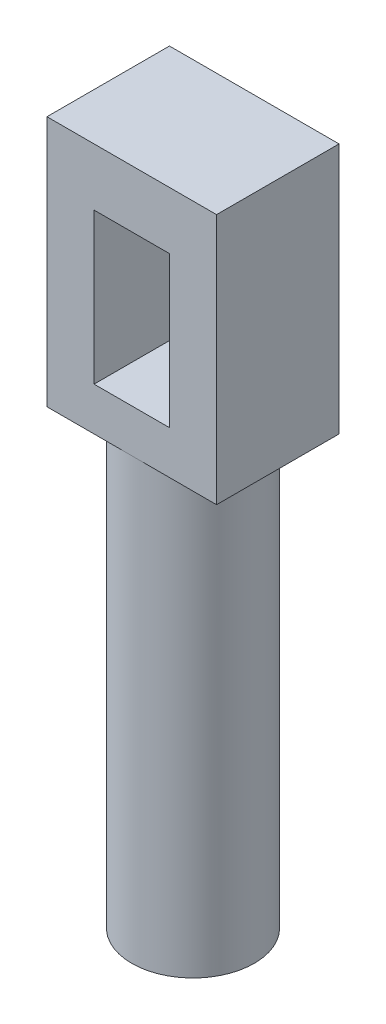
ISO-10303-21;
HEADER;
FILE_DESCRIPTION(('STEP AP214'),'2;1');
FILE_NAME('part.step','',(''),(''),'','','');
FILE_SCHEMA(('AUTOMOTIVE_DESIGN { 1 0 10303 214 1 1 1 1 }'));
ENDSEC;
DATA;
#1=APPLICATION_CONTEXT('core data for automotive mechanical design processes');
#2=APPLICATION_PROTOCOL_DEFINITION('international standard','automotive_design',2000,#1);
#3=PRODUCT_CONTEXT('',#1,'mechanical');
#4=PRODUCT('Part','Part','',(#3));
#5=PRODUCT_RELATED_PRODUCT_CATEGORY('part','',(#4));
#6=PRODUCT_DEFINITION_FORMATION('','',#4);
#7=PRODUCT_DEFINITION_CONTEXT('part definition',#1,'design');
#8=PRODUCT_DEFINITION('design','',#6,#7);
#9=PRODUCT_DEFINITION_SHAPE('','',#8);
#10=(LENGTH_UNIT() NAMED_UNIT(*) SI_UNIT(.MILLI.,.METRE.));
#11=(NAMED_UNIT(*) PLANE_ANGLE_UNIT() SI_UNIT($,.RADIAN.));
#12=(NAMED_UNIT(*) SI_UNIT($,.STERADIAN.) SOLID_ANGLE_UNIT());
#13=UNCERTAINTY_MEASURE_WITH_UNIT(LENGTH_MEASURE(1.E-05),#10,'distance_accuracy_value','');
#14=(GEOMETRIC_REPRESENTATION_CONTEXT(3) GLOBAL_UNCERTAINTY_ASSIGNED_CONTEXT((#13)) GLOBAL_UNIT_ASSIGNED_CONTEXT((#10,
#11,#12)) REPRESENTATION_CONTEXT('',''));
#15=CARTESIAN_POINT('',(0.,0.,0.));
#16=DIRECTION('',(0.,0.,1.));
#17=DIRECTION('',(1.,0.,0.));
#18=AXIS2_PLACEMENT_3D('',#15,#16,#17);
#19=CARTESIAN_POINT('',(0.,70.,0.));
#20=DIRECTION('',(0.,-1.,0.));
#21=DIRECTION('',(0.,0.,-1.));
#22=AXIS2_PLACEMENT_3D('',#19,#20,#21);
#23=CYLINDRICAL_SURFACE('',#22,9.75);
#24=CARTESIAN_POINT('',(0.,70.,0.));
#25=DIRECTION('',(0.,1.,0.));
#26=DIRECTION('',(0.,0.,1.));
#27=AXIS2_PLACEMENT_3D('',#24,#25,#26);
#28=CIRCLE('',#27,9.75);
#29=CARTESIAN_POINT('',(0.,70.,9.75));
#30=VERTEX_POINT('',#29);
#31=CARTESIAN_POINT('',(0.,70.,-9.75));
#32=VERTEX_POINT('',#31);
#33=EDGE_CURVE('E167',#30,#32,#28,.T.);
#34=ORIENTED_EDGE('',*,*,#33,.F.);
#35=EDGE_CURVE('E171',#32,#30,#28,.T.);
#36=ORIENTED_EDGE('',*,*,#35,.F.);
#37=EDGE_LOOP('',(#34,#36));
#38=FACE_BOUND('',#37,.T.);
#39=CARTESIAN_POINT('',(0.,0.,0.));
#40=DIRECTION('',(0.,1.,0.));
#41=DIRECTION('',(0.,0.,1.));
#42=AXIS2_PLACEMENT_3D('',#39,#40,#41);
#43=CIRCLE('',#42,9.75);
#44=CARTESIAN_POINT('',(0.,0.,9.75));
#45=VERTEX_POINT('',#44);
#46=EDGE_CURVE('E166',#45,#45,#43,.T.);
#47=ORIENTED_EDGE('',*,*,#46,.T.);
#48=EDGE_LOOP('',(#47));
#49=FACE_BOUND('',#48,.T.);
#50=ADVANCED_FACE('F34',(#38,#49),#23,.T.);
#51=CARTESIAN_POINT('',(0.,0.,0.));
#52=DIRECTION('',(0.,1.,0.));
#53=DIRECTION('',(0.,0.,1.));
#54=AXIS2_PLACEMENT_3D('',#51,#52,#53);
#55=PLANE('',#54);
#56=ORIENTED_EDGE('',*,*,#46,.F.);
#57=EDGE_LOOP('',(#56));
#58=FACE_BOUND('',#57,.T.);
#59=ADVANCED_FACE('F195',(#58),#55,.F.);
#60=CARTESIAN_POINT('',(0.,70.,0.));
#61=DIRECTION('',(0.,1.,0.));
#62=DIRECTION('',(0.,0.,1.));
#63=AXIS2_PLACEMENT_3D('',#60,#61,#62);
#64=PLANE('',#63);
#65=DIRECTION('',(1.,0.,0.));
#66=VECTOR('',#65,1.);
#67=CARTESIAN_POINT('',(-13.5,70.,9.75));
#68=LINE('',#67,#66);
#69=CARTESIAN_POINT('',(13.5,70.,9.75));
#70=VERTEX_POINT('',#69);
#71=EDGE_CURVE('E152',#30,#70,#68,.T.);
#72=ORIENTED_EDGE('',*,*,#71,.F.);
#73=ORIENTED_EDGE('',*,*,#33,.T.);
#74=DIRECTION('',(-1.,0.,0.));
#75=VECTOR('',#74,1.);
#76=CARTESIAN_POINT('',(-13.5,70.,-9.75));
#77=LINE('',#76,#75);
#78=CARTESIAN_POINT('',(13.5,70.,-9.75));
#79=VERTEX_POINT('',#78);
#80=EDGE_CURVE('E147',#79,#32,#77,.T.);
#81=ORIENTED_EDGE('',*,*,#80,.F.);
#82=DIRECTION('',(0.,0.,-1.));
#83=VECTOR('',#82,1.);
#84=CARTESIAN_POINT('',(13.5,70.,-9.75));
#85=LINE('',#84,#83);
#86=EDGE_CURVE('E130',#70,#79,#85,.T.);
#87=ORIENTED_EDGE('',*,*,#86,.F.);
#88=EDGE_LOOP('',(#72,#73,#81,#87));
#89=FACE_BOUND('',#88,.T.);
#90=ADVANCED_FACE('F200',(#89),#64,.F.);
#91=CARTESIAN_POINT('',(-13.5,70.,-9.75));
#92=VERTEX_POINT('',#91);
#93=EDGE_CURVE('E146',#32,#92,#77,.T.);
#94=ORIENTED_EDGE('',*,*,#93,.F.);
#95=ORIENTED_EDGE('',*,*,#35,.T.);
#96=CARTESIAN_POINT('',(-13.5,70.,9.75));
#97=VERTEX_POINT('',#96);
#98=EDGE_CURVE('E137',#97,#30,#68,.T.);
#99=ORIENTED_EDGE('',*,*,#98,.F.);
#100=DIRECTION('',(0.,0.,1.));
#101=VECTOR('',#100,1.);
#102=CARTESIAN_POINT('',(-13.5,70.,-9.75));
#103=LINE('',#102,#101);
#104=EDGE_CURVE('E150',#92,#97,#103,.T.);
#105=ORIENTED_EDGE('',*,*,#104,.F.);
#106=EDGE_LOOP('',(#94,#95,#99,#105));
#107=FACE_BOUND('',#106,.T.);
#108=ADVANCED_FACE('F210',(#107),#64,.F.);
#109=CARTESIAN_POINT('',(13.5,110.,-9.75));
#110=DIRECTION('',(-1.,0.,0.));
#111=DIRECTION('',(0.,0.,1.));
#112=AXIS2_PLACEMENT_3D('',#109,#110,#111);
#113=PLANE('',#112);
#114=ORIENTED_EDGE('',*,*,#86,.T.);
#115=DIRECTION('',(0.,-1.,0.));
#116=VECTOR('',#115,1.);
#117=CARTESIAN_POINT('',(13.5,110.,-9.75));
#118=LINE('',#117,#116);
#119=CARTESIAN_POINT('',(13.5,110.,-9.75));
#120=VERTEX_POINT('',#119);
#121=EDGE_CURVE('E163',#120,#79,#118,.T.);
#122=ORIENTED_EDGE('',*,*,#121,.F.);
#123=DIRECTION('',(0.,0.,-1.));
#124=VECTOR('',#123,1.);
#125=CARTESIAN_POINT('',(13.5,110.,-9.75));
#126=LINE('',#125,#124);
#127=CARTESIAN_POINT('',(13.5,110.,9.75));
#128=VERTEX_POINT('',#127);
#129=EDGE_CURVE('E133',#128,#120,#126,.T.);
#130=ORIENTED_EDGE('',*,*,#129,.F.);
#131=DIRECTION('',(0.,-1.,0.));
#132=VECTOR('',#131,1.);
#133=CARTESIAN_POINT('',(13.5,110.,9.75));
#134=LINE('',#133,#132);
#135=EDGE_CURVE('E143',#128,#70,#134,.T.);
#136=ORIENTED_EDGE('',*,*,#135,.T.);
#137=EDGE_LOOP('',(#114,#122,#130,#136));
#138=FACE_BOUND('',#137,.T.);
#139=ADVANCED_FACE('F223',(#138),#113,.F.);
#140=CARTESIAN_POINT('',(-13.5,110.,-9.75));
#141=DIRECTION('',(0.,0.,1.));
#142=DIRECTION('',(1.,0.,0.));
#143=AXIS2_PLACEMENT_3D('',#140,#141,#142);
#144=PLANE('',#143);
#145=DIRECTION('',(1.,0.,0.));
#146=VECTOR('',#145,1.);
#147=CARTESIAN_POINT('',(5.99999999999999,100.875497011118,-9.75));
#148=LINE('',#147,#146);
#149=CARTESIAN_POINT('',(-6.00000000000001,100.875497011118,-9.75));
#150=VERTEX_POINT('',#149);
#151=CARTESIAN_POINT('',(5.99999999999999,100.875497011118,-9.75));
#152=VERTEX_POINT('',#151);
#153=EDGE_CURVE('E116',#150,#152,#148,.T.);
#154=ORIENTED_EDGE('',*,*,#153,.F.);
#155=DIRECTION('',(0.,1.,0.));
#156=VECTOR('',#155,1.);
#157=CARTESIAN_POINT('',(-6.00000000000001,100.875497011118,-9.75));
#158=LINE('',#157,#156);
#159=CARTESIAN_POINT('',(-6.00000000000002,76.8754970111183,-9.75));
#160=VERTEX_POINT('',#159);
#161=EDGE_CURVE('E48',#160,#150,#158,.T.);
#162=ORIENTED_EDGE('',*,*,#161,.F.);
#163=DIRECTION('',(-1.,0.,0.));
#164=VECTOR('',#163,1.);
#165=CARTESIAN_POINT('',(5.99999999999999,76.8754970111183,-9.75));
#166=LINE('',#165,#164);
#167=CARTESIAN_POINT('',(5.99999999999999,76.8754970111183,-9.75));
#168=VERTEX_POINT('',#167);
#169=EDGE_CURVE('E123',#168,#160,#166,.T.);
#170=ORIENTED_EDGE('',*,*,#169,.F.);
#171=DIRECTION('',(0.,-1.,0.));
#172=VECTOR('',#171,1.);
#173=CARTESIAN_POINT('',(5.99999999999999,100.875497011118,-9.75));
#174=LINE('',#173,#172);
#175=EDGE_CURVE('E107',#152,#168,#174,.T.);
#176=ORIENTED_EDGE('',*,*,#175,.F.);
#177=EDGE_LOOP('',(#154,#162,#170,#176));
#178=FACE_BOUND('',#177,.T.);
#179=ORIENTED_EDGE('',*,*,#80,.T.);
#180=ORIENTED_EDGE('',*,*,#93,.T.);
#181=DIRECTION('',(0.,-1.,0.));
#182=VECTOR('',#181,1.);
#183=CARTESIAN_POINT('',(-13.5,110.,-9.75));
#184=LINE('',#183,#182);
#185=CARTESIAN_POINT('',(-13.5,110.,-9.75));
#186=VERTEX_POINT('',#185);
#187=EDGE_CURVE('E160',#186,#92,#184,.T.);
#188=ORIENTED_EDGE('',*,*,#187,.F.);
#189=DIRECTION('',(-1.,0.,0.));
#190=VECTOR('',#189,1.);
#191=CARTESIAN_POINT('',(-13.5,110.,-9.75));
#192=LINE('',#191,#190);
#193=EDGE_CURVE('E136',#120,#186,#192,.T.);
#194=ORIENTED_EDGE('',*,*,#193,.F.);
#195=ORIENTED_EDGE('',*,*,#121,.T.);
#196=EDGE_LOOP('',(#179,#180,#188,#194,#195));
#197=FACE_BOUND('',#196,.T.);
#198=ADVANCED_FACE('F120',(#178,#197),#144,.F.);
#199=CARTESIAN_POINT('',(-13.5,110.,-9.75));
#200=DIRECTION('',(1.,0.,0.));
#201=DIRECTION('',(0.,0.,-1.));
#202=AXIS2_PLACEMENT_3D('',#199,#200,#201);
#203=PLANE('',#202);
#204=ORIENTED_EDGE('',*,*,#104,.T.);
#205=DIRECTION('',(0.,-1.,0.));
#206=VECTOR('',#205,1.);
#207=CARTESIAN_POINT('',(-13.5,110.,9.75));
#208=LINE('',#207,#206);
#209=CARTESIAN_POINT('',(-13.5,110.,9.75));
#210=VERTEX_POINT('',#209);
#211=EDGE_CURVE('E157',#210,#97,#208,.T.);
#212=ORIENTED_EDGE('',*,*,#211,.F.);
#213=DIRECTION('',(0.,0.,1.));
#214=VECTOR('',#213,1.);
#215=CARTESIAN_POINT('',(-13.5,110.,-9.75));
#216=LINE('',#215,#214);
#217=EDGE_CURVE('E139',#186,#210,#216,.T.);
#218=ORIENTED_EDGE('',*,*,#217,.F.);
#219=ORIENTED_EDGE('',*,*,#187,.T.);
#220=EDGE_LOOP('',(#204,#212,#218,#219));
#221=FACE_BOUND('',#220,.T.);
#222=ADVANCED_FACE('F218',(#221),#203,.F.);
#223=CARTESIAN_POINT('',(-13.5,110.,9.75));
#224=DIRECTION('',(0.,0.,-1.));
#225=DIRECTION('',(-1.,0.,0.));
#226=AXIS2_PLACEMENT_3D('',#223,#224,#225);
#227=PLANE('',#226);
#228=DIRECTION('',(-1.,0.,0.));
#229=VECTOR('',#228,1.);
#230=CARTESIAN_POINT('',(-13.5,76.8754970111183,9.75));
#231=LINE('',#230,#229);
#232=CARTESIAN_POINT('',(5.99999999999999,76.8754970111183,9.75));
#233=VERTEX_POINT('',#232);
#234=CARTESIAN_POINT('',(-6.00000000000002,76.8754970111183,9.75));
#235=VERTEX_POINT('',#234);
#236=EDGE_CURVE('E41',#233,#235,#231,.T.);
#237=ORIENTED_EDGE('',*,*,#236,.T.);
#238=DIRECTION('',(0.,1.,0.));
#239=VECTOR('',#238,1.);
#240=CARTESIAN_POINT('',(-6.00000000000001,110.,9.75));
#241=LINE('',#240,#239);
#242=CARTESIAN_POINT('',(-6.00000000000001,100.875497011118,9.75));
#243=VERTEX_POINT('',#242);
#244=EDGE_CURVE('E11',#235,#243,#241,.T.);
#245=ORIENTED_EDGE('',*,*,#244,.T.);
#246=DIRECTION('',(1.,0.,0.));
#247=VECTOR('',#246,1.);
#248=CARTESIAN_POINT('',(-13.5,100.875497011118,9.75));
#249=LINE('',#248,#247);
#250=CARTESIAN_POINT('',(5.99999999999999,100.875497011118,9.75));
#251=VERTEX_POINT('',#250);
#252=EDGE_CURVE('E170',#243,#251,#249,.T.);
#253=ORIENTED_EDGE('',*,*,#252,.T.);
#254=DIRECTION('',(0.,-1.,0.));
#255=VECTOR('',#254,1.);
#256=CARTESIAN_POINT('',(6.,110.,9.75));
#257=LINE('',#256,#255);
#258=EDGE_CURVE('E110',#251,#233,#257,.T.);
#259=ORIENTED_EDGE('',*,*,#258,.T.);
#260=EDGE_LOOP('',(#237,#245,#253,#259));
#261=FACE_BOUND('',#260,.T.);
#262=ORIENTED_EDGE('',*,*,#98,.T.);
#263=ORIENTED_EDGE('',*,*,#71,.T.);
#264=ORIENTED_EDGE('',*,*,#135,.F.);
#265=DIRECTION('',(1.,0.,0.));
#266=VECTOR('',#265,1.);
#267=CARTESIAN_POINT('',(-13.5,110.,9.75));
#268=LINE('',#267,#266);
#269=EDGE_CURVE('E141',#210,#128,#268,.T.);
#270=ORIENTED_EDGE('',*,*,#269,.F.);
#271=ORIENTED_EDGE('',*,*,#211,.T.);
#272=EDGE_LOOP('',(#262,#263,#264,#270,#271));
#273=FACE_BOUND('',#272,.T.);
#274=ADVANCED_FACE('F177',(#261,#273),#227,.F.);
#275=CARTESIAN_POINT('',(0.,110.,0.));
#276=DIRECTION('',(0.,1.,0.));
#277=DIRECTION('',(0.,0.,1.));
#278=AXIS2_PLACEMENT_3D('',#275,#276,#277);
#279=PLANE('',#278);
#280=ORIENTED_EDGE('',*,*,#129,.T.);
#281=ORIENTED_EDGE('',*,*,#193,.T.);
#282=ORIENTED_EDGE('',*,*,#217,.T.);
#283=ORIENTED_EDGE('',*,*,#269,.T.);
#284=EDGE_LOOP('',(#280,#281,#282,#283));
#285=FACE_BOUND('',#284,.T.);
#286=ADVANCED_FACE('F184',(#285),#279,.T.);
#287=CARTESIAN_POINT('',(-6.00000000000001,100.875497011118,30.25));
#288=DIRECTION('',(-1.,0.,0.));
#289=DIRECTION('',(0.,-1.,0.));
#290=AXIS2_PLACEMENT_3D('',#287,#288,#289);
#291=PLANE('',#290);
#292=DIRECTION('',(0.,0.,-1.));
#293=VECTOR('',#292,1.);
#294=CARTESIAN_POINT('',(-6.00000000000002,76.8754970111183,30.25));
#295=LINE('',#294,#293);
#296=EDGE_CURVE('E128',#235,#160,#295,.T.);
#297=ORIENTED_EDGE('',*,*,#296,.T.);
#298=ORIENTED_EDGE('',*,*,#161,.T.);
#299=DIRECTION('',(0.,0.,-1.));
#300=VECTOR('',#299,1.);
#301=CARTESIAN_POINT('',(-6.00000000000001,100.875497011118,30.25));
#302=LINE('',#301,#300);
#303=EDGE_CURVE('E113',#243,#150,#302,.T.);
#304=ORIENTED_EDGE('',*,*,#303,.F.);
#305=ORIENTED_EDGE('',*,*,#244,.F.);
#306=EDGE_LOOP('',(#297,#298,#304,#305));
#307=FACE_BOUND('',#306,.T.);
#308=ADVANCED_FACE('F182',(#307),#291,.F.);
#309=CARTESIAN_POINT('',(5.99999999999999,76.8754970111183,30.25));
#310=DIRECTION('',(0.,-1.,0.));
#311=DIRECTION('',(0.,0.,-1.));
#312=AXIS2_PLACEMENT_3D('',#309,#310,#311);
#313=PLANE('',#312);
#314=DIRECTION('',(0.,0.,-1.));
#315=VECTOR('',#314,1.);
#316=CARTESIAN_POINT('',(5.99999999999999,76.8754970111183,30.25));
#317=LINE('',#316,#315);
#318=EDGE_CURVE('E112',#233,#168,#317,.T.);
#319=ORIENTED_EDGE('',*,*,#318,.T.);
#320=ORIENTED_EDGE('',*,*,#169,.T.);
#321=ORIENTED_EDGE('',*,*,#296,.F.);
#322=ORIENTED_EDGE('',*,*,#236,.F.);
#323=EDGE_LOOP('',(#319,#320,#321,#322));
#324=FACE_BOUND('',#323,.T.);
#325=ADVANCED_FACE('F181',(#324),#313,.F.);
#326=CARTESIAN_POINT('',(5.99999999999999,100.875497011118,30.25));
#327=DIRECTION('',(1.,0.,0.));
#328=DIRECTION('',(0.,1.,0.));
#329=AXIS2_PLACEMENT_3D('',#326,#327,#328);
#330=PLANE('',#329);
#331=DIRECTION('',(0.,0.,-1.));
#332=VECTOR('',#331,1.);
#333=CARTESIAN_POINT('',(5.99999999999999,100.875497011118,30.25));
#334=LINE('',#333,#332);
#335=EDGE_CURVE('E56',#251,#152,#334,.T.);
#336=ORIENTED_EDGE('',*,*,#335,.T.);
#337=ORIENTED_EDGE('',*,*,#175,.T.);
#338=ORIENTED_EDGE('',*,*,#318,.F.);
#339=ORIENTED_EDGE('',*,*,#258,.F.);
#340=EDGE_LOOP('',(#336,#337,#338,#339));
#341=FACE_BOUND('',#340,.T.);
#342=ADVANCED_FACE('F104',(#341),#330,.F.);
#343=CARTESIAN_POINT('',(5.99999999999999,100.875497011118,30.25));
#344=DIRECTION('',(0.,1.,0.));
#345=DIRECTION('',(0.,0.,1.));
#346=AXIS2_PLACEMENT_3D('',#343,#344,#345);
#347=PLANE('',#346);
#348=ORIENTED_EDGE('',*,*,#303,.T.);
#349=ORIENTED_EDGE('',*,*,#153,.T.);
#350=ORIENTED_EDGE('',*,*,#335,.F.);
#351=ORIENTED_EDGE('',*,*,#252,.F.);
#352=EDGE_LOOP('',(#348,#349,#350,#351));
#353=FACE_BOUND('',#352,.T.);
#354=ADVANCED_FACE('F117',(#353),#347,.F.);
#355=CLOSED_SHELL('',(#50,#59,#90,#108,#139,#198,#222,#274,#286,#308,#325,#342,#354));
#356=MANIFOLD_SOLID_BREP('B2',#355);
#357=ADVANCED_BREP_SHAPE_REPRESENTATION('',(#18,#356),#14);
#358=SHAPE_DEFINITION_REPRESENTATION(#9,#357);
ENDSEC;
END-ISO-10303-21;
